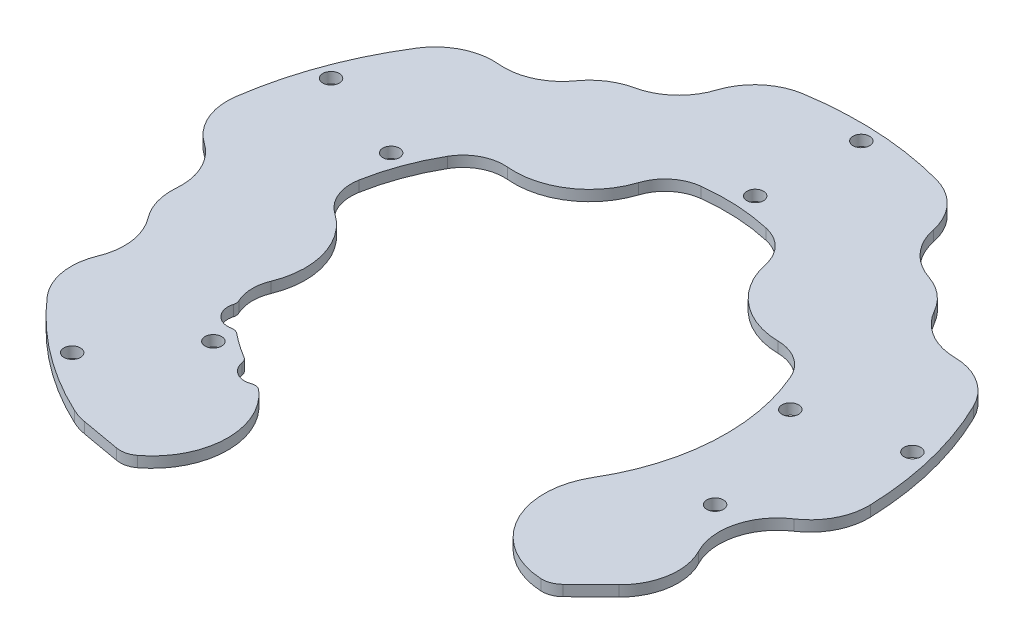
from build123d import *

# Parameters (mm, degrees)
BOSS_EXTRUDE1_DEPTH          = 3.175
BOSS_EXTRUDE2_START          = -3.175
BOSS_EXTRUDE2_DEPTH          = 3.175
F_10_0_1935_DIAMETER_HOLE1_D = 4.9149


with BuildPart() as part:
    # Sketch1 → Boss-Extrude1 (new body)
    with BuildSketch(Plane(origin=(0, 0, 0), x_dir=(1, 0, 0), z_dir=(0, 1, 0))):
        with BuildLine():
            ThreePointArc((56.104408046, -33.36933745), (65.154662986, -4.010882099), (59.773674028, 26.235951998))
            ThreePointArc((59.773674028, 26.235951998), (53.518032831, 33.679174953), (44.232955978, 36.563956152))
            ThreePointArc((44.232955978, 36.563956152), (33.502265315, 40.522145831), (27.597548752, 50.317517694))
            ThreePointArc((27.597548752, 50.317517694), (23.018843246, 58.894817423), (14.532407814, 63.63981778))
            ThreePointArc((14.532407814, 63.63981778), (3.509267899, 65.183604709), (-7.615902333, 64.832208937))
            ThreePointArc((-7.615902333, 64.832208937), (-16.562719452, 61.025756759), (-22.035837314, 52.989613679))
            ThreePointArc((-22.035837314, 52.989613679), (-28.958076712, 43.884802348), (-40.051703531, 41.101561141))
            ThreePointArc((-40.051703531, 41.101561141), (-49.592828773, 39.23031988), (-56.61143268, 32.501738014))
            ThreePointArc((-56.61143268, 32.501738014), (-61.310233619, 22.411437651), (-64.226468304, 11.669535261))
            ThreePointArc((-64.226468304, 11.669535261), (-63.201768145, 2.000791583), (-57.116662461, -5.582486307))
            ThreePointArc((-57.116662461, -5.582486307), (-50.433201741, -14.863991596), (-51.014602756, -26.286642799))
            ThreePointArc((-51.014602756, -26.286642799), (-52.014312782, -35.9580023), (-47.63144879, -44.637006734))
            ThreePointArc((-47.63144879, -44.637006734), (-38.304343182, -52.858249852), (-27.58767489, -59.161959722))
            ThreePointArc((-27.58767489, -59.161959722), (-19.233389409, -82.115170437), (-42.186600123, -90.469455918))
            ThreePointArc((-42.186600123, -90.469455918), (-60.181848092, -79.640296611), (-75.513001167, -65.285667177))
            ThreePointArc((-75.513001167, -65.285667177), (-79.49647233, -56.753871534), (-78.412979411, -47.400496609))
            ThreePointArc((-78.412979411, -47.400496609), (-77.257535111, -38.534827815), (-80.689725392, -30.279211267))
            ThreePointArc((-80.689725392, -30.279211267), (-83.568058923, -24.629705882), (-84.213774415, -18.322189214))
            ThreePointArc((-84.213774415, -18.322189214), (-85.807568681, -9.524748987), (-91.586555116, -2.702839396))
            ThreePointArc((-91.586555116, -2.702839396), (-97.569594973, 4.56784238), (-98.850010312, 13.8962997))
            ThreePointArc((-98.850010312, 13.8962997), (-93.754559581, 34.271186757), (-84.508836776, 53.12897694))
            ThreePointArc((-84.508836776, 53.12897694), (-77.51425435, 59.432578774), (-68.25273011, 61.130739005))
            ThreePointArc((-68.25273011, 61.130739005), (-59.436573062, 62.617517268), (-52.544946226, 68.313183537))
            ThreePointArc((-52.544946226, 68.313183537), (-47.983673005, 72.717329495), (-42.140460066, 75.178747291))
            ThreePointArc((-42.140460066, 75.178747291), (-34.193250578, 79.274720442), (-29.358751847, 86.795541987))
            ThreePointArc((-29.358751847, 86.795541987), (-24.154737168, 94.642695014), (-15.608095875, 98.594213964))
            ThreePointArc((-15.608095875, 98.594213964), (5.36631239, 99.677652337), (26.103167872, 96.348618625))
            ThreePointArc((26.103167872, 96.348618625), (34.176165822, 91.502353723), (38.507613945, 83.141843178))
            ThreePointArc((38.507613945, 83.141843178), (42.50671758, 75.14544994), (49.968239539, 70.219922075))
            ThreePointArc((49.968239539, 70.219922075), (55.513415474, 67.145391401), (59.57548585, 62.276993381))
            ThreePointArc((59.57548585, 62.276993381), (65.815779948, 55.874348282), (74.421355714, 53.449642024))
            ThreePointArc((74.421355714, 53.449642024), (83.447030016, 50.766960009), (89.724415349, 43.748839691))
            ThreePointArc((89.724415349, 43.748839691), (96.892084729, 24.00740721), (99.770591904, 3.203228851))
            ThreePointArc((99.770591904, 3.203228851), (97.84827123, -5.287159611), (92.028968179, -11.761549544))
            ThreePointArc((92.028968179, -11.761549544), (84.824989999, -21.86151229), (86.249801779, -34.185329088))
            ThreePointArc((86.249801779, -34.185329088), (70.481797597, -59.464254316), (56.104408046, -33.36933745))
        make_face()
    extrude(amount=BOSS_EXTRUDE1_DEPTH)

    # Sketch4 → Boss-Extrude2 (add)
    with BuildSketch(Plane(origin=(0, 3.175, 0), x_dir=(1, 0, 0), z_dir=(0, 1, 0)).offset(BOSS_EXTRUDE2_START)):
        with BuildLine():
            Line((-37.886388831, -91.82530733), (-26.369024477, -93.856129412))
            ThreePointArc((-26.369024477, -93.856129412), (-23.786266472, -93.777697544), (-21.448589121, -92.676763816))
            ThreePointArc((-21.448589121, -92.676763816), (-12.546819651, -75.538274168), (-20.322501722, -57.860375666))
            ThreePointArc((-20.322501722, -57.860375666), (-21.53199771, -57.286505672), (-22.865271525, -57.40728749))
            ThreePointArc((-22.865271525, -57.40728749), (-27.193613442, -57.039535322), (-29.655226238, -53.460394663))
            ThreePointArc((-29.655226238, -53.460394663), (-30.061299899, -52.439707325), (-30.860380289, -51.685937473))
            ThreePointArc((-30.860380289, -51.685937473), (-34.528154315, -49.311314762), (-38.014022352, -46.676903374))
            ThreePointArc((-38.014022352, -46.676903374), (-38.99563591, -46.183817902), (-40.093653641, -46.151329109))
            ThreePointArc((-40.093653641, -46.151329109), (-44.794486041, -44.588681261), (-45.929858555, -39.766791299))
            ThreePointArc((-45.929858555, -39.766791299), (-45.840375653, -38.867164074), (-46.071655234, -37.993181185))
            ThreePointArc((-46.071655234, -37.993181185), (-47.216872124, -33.126905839), (-46.31282994, -28.21011164))
            ThreePointArc((-46.31282994, -28.21011164), (-45.560428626, -13.427857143), (-54.209613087, -1.416497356))
            ThreePointArc((-54.209613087, -1.416497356), (-58.504981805, 3.936404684), (-59.228299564, 10.761400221))
            ThreePointArc((-59.228299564, 10.761400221), (-56.539009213, 20.6673569), (-52.205873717, 29.97241988))
            ThreePointArc((-52.205873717, 29.97241988), (-47.251565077, 34.72200708), (-40.516653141, 36.042883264))
            ThreePointArc((-40.516653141, 36.042883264), (-26.160194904, 39.644724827), (-17.202002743, 51.427421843))
            ThreePointArc((-17.202002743, 51.427421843), (-13.338625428, 57.099993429), (-7.023225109, 59.786900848))
            ThreePointArc((-7.023225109, 59.786900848), (3.23617312, 60.110950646), (13.401481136, 58.687302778))
            ThreePointArc((13.401481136, 58.687302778), (19.391906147, 55.337890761), (22.623933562, 49.283326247))
            ThreePointArc((22.623933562, 49.283326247), (30.265331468, 36.606962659), (44.15210762, 31.484599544))
            ThreePointArc((44.15210762, 31.484599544), (50.706279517, 29.448283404), (55.122026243, 24.194243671))
            ThreePointArc((55.122026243, 24.194243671), (60.084261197, -3.698751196), (51.738306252, -30.77250185))
            ThreePointArc((51.738306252, -30.77250185), (51.264695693, -52.78791272), (69.896005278, -64.525754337))
            ThreePointArc((69.896005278, -64.525754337), (72.447866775, -64.119806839), (74.626720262, -62.730782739))
            Line((74.626720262, -62.730782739), (83.00290205, -54.569073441))
            ThreePointArc((83.00290205, -54.569073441), (60.257820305, -55.763878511), (56.104408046, -33.36933745))
            ThreePointArc((56.104408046, -33.36933745), (65.154662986, -4.010882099), (59.773674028, 26.235951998))
            ThreePointArc((59.773674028, 26.235951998), (53.518032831, 33.679174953), (44.232955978, 36.563956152))
            ThreePointArc((44.232955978, 36.563956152), (33.502265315, 40.522145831), (27.597548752, 50.317517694))
            ThreePointArc((27.597548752, 50.317517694), (23.018843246, 58.894817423), (14.532407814, 63.63981778))
            ThreePointArc((14.532407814, 63.63981778), (3.509267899, 65.183604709), (-7.615902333, 64.832208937))
            ThreePointArc((-7.615902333, 64.832208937), (-16.562719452, 61.025756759), (-22.035837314, 52.989613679))
            ThreePointArc((-22.035837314, 52.989613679), (-28.958076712, 43.884802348), (-40.051703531, 41.101561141))
            ThreePointArc((-40.051703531, 41.101561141), (-49.592828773, 39.23031988), (-56.61143268, 32.501738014))
            ThreePointArc((-56.61143268, 32.501738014), (-61.310233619, 22.411437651), (-64.226468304, 11.669535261))
            ThreePointArc((-64.226468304, 11.669535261), (-63.201768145, 2.000791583), (-57.116662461, -5.582486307))
            ThreePointArc((-57.116662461, -5.582486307), (-50.433201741, -14.863991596), (-51.014602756, -26.286642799))
            ThreePointArc((-51.014602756, -26.286642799), (-52.014312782, -35.9580023), (-47.63144879, -44.637006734))
            ThreePointArc((-47.63144879, -44.637006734), (-38.304343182, -52.858249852), (-27.58767489, -59.161959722))
            ThreePointArc((-27.58767489, -59.161959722), (-18.414538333, -80.009498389), (-37.886388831, -91.82530733))
        make_face()
    extrude(amount=BOSS_EXTRUDE2_DEPTH)

    # 10 _0.1935_ Diameter Hole1 (through all)
    with Locations(Plane(origin=(0, 3.175, 0), x_dir=(1, 0, 0), z_dir=(0, 1, 0))):
        with Locations((-57.425427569, -75.992649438), (-89.460457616, 32.701514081), (5.120527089, 95.11226368), (92.454279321, 22.907831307), (76.728320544, -19.774798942), (-39.432126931, -52.18161928), (-61.429514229, 22.455039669), (3.516095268, 65.31042106), (63.485271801, 15.730044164)):
            Hole(F_10_0_1935_DIAMETER_HOLE1_D / 2)


solid = part.part
